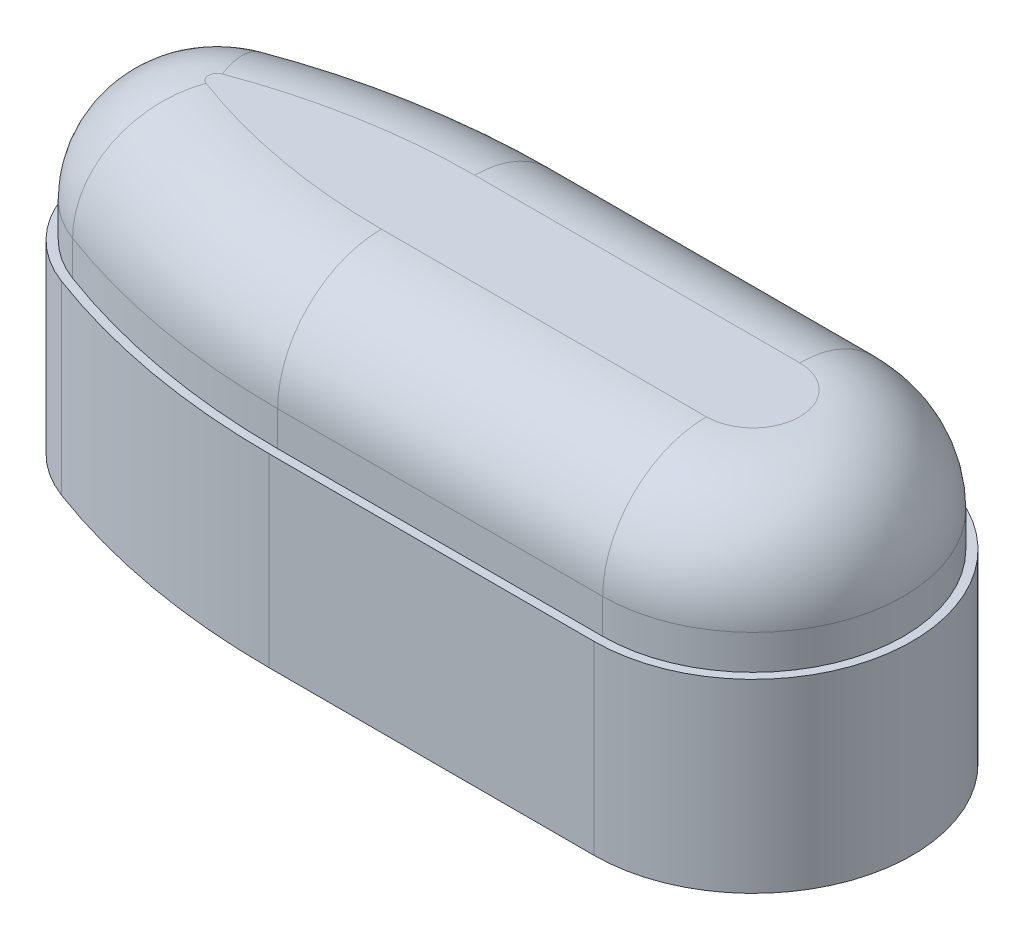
ISO-10303-21;
HEADER;
FILE_DESCRIPTION(('STEP AP214'),'2;1');
FILE_NAME('part.step','',(''),(''),'','','');
FILE_SCHEMA(('AUTOMOTIVE_DESIGN { 1 0 10303 214 1 1 1 1 }'));
ENDSEC;
DATA;
#1=APPLICATION_CONTEXT('core data for automotive mechanical design processes');
#2=APPLICATION_PROTOCOL_DEFINITION('international standard','automotive_design',2000,#1);
#3=PRODUCT_CONTEXT('',#1,'mechanical');
#4=PRODUCT('Part','Part','',(#3));
#5=PRODUCT_RELATED_PRODUCT_CATEGORY('part','',(#4));
#6=PRODUCT_DEFINITION_FORMATION('','',#4);
#7=PRODUCT_DEFINITION_CONTEXT('part definition',#1,'design');
#8=PRODUCT_DEFINITION('design','',#6,#7);
#9=PRODUCT_DEFINITION_SHAPE('','',#8);
#10=(LENGTH_UNIT() NAMED_UNIT(*) SI_UNIT(.MILLI.,.METRE.));
#11=(NAMED_UNIT(*) PLANE_ANGLE_UNIT() SI_UNIT($,.RADIAN.));
#12=(NAMED_UNIT(*) SI_UNIT($,.STERADIAN.) SOLID_ANGLE_UNIT());
#13=UNCERTAINTY_MEASURE_WITH_UNIT(LENGTH_MEASURE(1.E-05),#10,'distance_accuracy_value','');
#14=(GEOMETRIC_REPRESENTATION_CONTEXT(3) GLOBAL_UNCERTAINTY_ASSIGNED_CONTEXT((#13)) GLOBAL_UNIT_ASSIGNED_CONTEXT((#10,
#11,#12)) REPRESENTATION_CONTEXT('',''));
#15=CARTESIAN_POINT('',(0.,0.,0.));
#16=DIRECTION('',(0.,0.,1.));
#17=DIRECTION('',(1.,0.,0.));
#18=AXIS2_PLACEMENT_3D('',#15,#16,#17);
#19=CARTESIAN_POINT('',(0.,18.72,0.));
#20=DIRECTION('',(0.,-1.,0.));
#21=DIRECTION('',(0.,0.,-1.));
#22=AXIS2_PLACEMENT_3D('',#19,#20,#21);
#23=CYLINDRICAL_SURFACE('',#22,9.2);
#24=CARTESIAN_POINT('',(0.,10.72,0.));
#25=DIRECTION('',(0.,1.,0.));
#26=DIRECTION('',(0.,0.,1.));
#27=AXIS2_PLACEMENT_3D('',#24,#25,#26);
#28=CIRCLE('',#27,9.2);
#29=CARTESIAN_POINT('',(0.,10.72,9.2));
#30=VERTEX_POINT('',#29);
#31=CARTESIAN_POINT('',(0.,10.72,-9.2));
#32=VERTEX_POINT('',#31);
#33=EDGE_CURVE('E724',#30,#32,#28,.T.);
#34=ORIENTED_EDGE('',*,*,#33,.F.);
#35=DIRECTION('',(0.,-1.,0.));
#36=VECTOR('',#35,1.);
#37=CARTESIAN_POINT('',(0.,18.72,9.2));
#38=LINE('',#37,#36);
#39=CARTESIAN_POINT('',(0.,0.,9.2));
#40=VERTEX_POINT('',#39);
#41=EDGE_CURVE('E727',#30,#40,#38,.T.);
#42=ORIENTED_EDGE('',*,*,#41,.T.);
#43=CARTESIAN_POINT('',(0.,0.,0.));
#44=DIRECTION('',(0.,1.,0.));
#45=DIRECTION('',(0.,0.,1.));
#46=AXIS2_PLACEMENT_3D('',#43,#44,#45);
#47=CIRCLE('',#46,9.2);
#48=CARTESIAN_POINT('',(0.,0.,-9.2));
#49=VERTEX_POINT('',#48);
#50=EDGE_CURVE('E730',#40,#49,#47,.T.);
#51=ORIENTED_EDGE('',*,*,#50,.T.);
#52=DIRECTION('',(0.,-1.,0.));
#53=VECTOR('',#52,1.);
#54=CARTESIAN_POINT('',(0.,18.72,-9.2));
#55=LINE('',#54,#53);
#56=EDGE_CURVE('E41',#32,#49,#55,.T.);
#57=ORIENTED_EDGE('',*,*,#56,.F.);
#58=EDGE_LOOP('',(#34,#42,#51,#57));
#59=FACE_BOUND('',#58,.T.);
#60=ADVANCED_FACE('F34',(#59),#23,.T.);
#61=CARTESIAN_POINT('',(0.,18.72,-9.2));
#62=DIRECTION('',(0.,0.,1.));
#63=DIRECTION('',(1.,0.,0.));
#64=AXIS2_PLACEMENT_3D('',#61,#62,#63);
#65=PLANE('',#64);
#66=DIRECTION('',(-1.,0.,0.));
#67=VECTOR('',#66,1.);
#68=CARTESIAN_POINT('',(0.,10.72,-9.2));
#69=LINE('',#68,#67);
#70=CARTESIAN_POINT('',(-18.8,10.72,-9.20000000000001));
#71=VERTEX_POINT('',#70);
#72=EDGE_CURVE('E731',#32,#71,#69,.T.);
#73=ORIENTED_EDGE('',*,*,#72,.F.);
#74=ORIENTED_EDGE('',*,*,#56,.T.);
#75=DIRECTION('',(-1.,0.,0.));
#76=VECTOR('',#75,1.);
#77=CARTESIAN_POINT('',(0.,0.,-9.2));
#78=LINE('',#77,#76);
#79=CARTESIAN_POINT('',(-18.8,0.,-9.19999999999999));
#80=VERTEX_POINT('',#79);
#81=EDGE_CURVE('E754',#49,#80,#78,.T.);
#82=ORIENTED_EDGE('',*,*,#81,.T.);
#83=DIRECTION('',(0.,-1.,0.));
#84=VECTOR('',#83,1.);
#85=CARTESIAN_POINT('',(-18.8,18.72,-9.19999999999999));
#86=LINE('',#85,#84);
#87=EDGE_CURVE('E750',#71,#80,#86,.T.);
#88=ORIENTED_EDGE('',*,*,#87,.F.);
#89=EDGE_LOOP('',(#73,#74,#82,#88));
#90=FACE_BOUND('',#89,.T.);
#91=ADVANCED_FACE('F715',(#90),#65,.F.);
#92=CARTESIAN_POINT('',(-18.8,18.72,32.7272727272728));
#93=DIRECTION('',(0.,-1.,0.));
#94=DIRECTION('',(0.,0.,-1.));
#95=AXIS2_PLACEMENT_3D('',#92,#93,#94);
#96=CYLINDRICAL_SURFACE('',#95,41.9272727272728);
#97=CARTESIAN_POINT('',(-18.8,10.72,32.7272727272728));
#98=DIRECTION('',(0.,1.,0.));
#99=DIRECTION('',(0.,0.,1.));
#100=AXIS2_PLACEMENT_3D('',#97,#98,#99);
#101=CIRCLE('',#100,41.9272727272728);
#102=CARTESIAN_POINT('',(-33.4450806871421,10.72,-6.55908381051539));
#103=VERTEX_POINT('',#102);
#104=EDGE_CURVE('E780',#71,#103,#101,.T.);
#105=ORIENTED_EDGE('',*,*,#104,.F.);
#106=ORIENTED_EDGE('',*,*,#87,.T.);
#107=CARTESIAN_POINT('',(-18.8,0.,32.7272727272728));
#108=DIRECTION('',(0.,1.,0.));
#109=DIRECTION('',(0.,0.,1.));
#110=AXIS2_PLACEMENT_3D('',#107,#108,#109);
#111=CIRCLE('',#110,41.9272727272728);
#112=CARTESIAN_POINT('',(-33.4450806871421,0.,-6.55908381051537));
#113=VERTEX_POINT('',#112);
#114=EDGE_CURVE('E760',#80,#113,#111,.T.);
#115=ORIENTED_EDGE('',*,*,#114,.T.);
#116=DIRECTION('',(0.,-1.,0.));
#117=VECTOR('',#116,1.);
#118=CARTESIAN_POINT('',(-33.4450806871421,18.72,-6.55908381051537));
#119=LINE('',#118,#117);
#120=EDGE_CURVE('E748',#103,#113,#119,.T.);
#121=ORIENTED_EDGE('',*,*,#120,.F.);
#122=EDGE_LOOP('',(#105,#106,#115,#121));
#123=FACE_BOUND('',#122,.T.);
#124=ADVANCED_FACE('F720',(#123),#96,.T.);
#125=CARTESIAN_POINT('',(-31.,18.72,0.));
#126=DIRECTION('',(0.,-1.,0.));
#127=DIRECTION('',(0.,0.,-1.));
#128=AXIS2_PLACEMENT_3D('',#125,#126,#127);
#129=CYLINDRICAL_SURFACE('',#128,7.00000000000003);
#130=CARTESIAN_POINT('',(-31.,10.72,0.));
#131=DIRECTION('',(0.,1.,0.));
#132=DIRECTION('',(0.,0.,1.));
#133=AXIS2_PLACEMENT_3D('',#130,#131,#132);
#134=CIRCLE('',#133,7.00000000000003);
#135=CARTESIAN_POINT('',(-33.4450806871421,10.72,6.55908381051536));
#136=VERTEX_POINT('',#135);
#137=EDGE_CURVE('E777',#103,#136,#134,.T.);
#138=ORIENTED_EDGE('',*,*,#137,.F.);
#139=ORIENTED_EDGE('',*,*,#120,.T.);
#140=CARTESIAN_POINT('',(-31.,0.,0.));
#141=DIRECTION('',(0.,1.,0.));
#142=DIRECTION('',(0.,0.,1.));
#143=AXIS2_PLACEMENT_3D('',#140,#141,#142);
#144=CIRCLE('',#143,7.00000000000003);
#145=CARTESIAN_POINT('',(-33.4450806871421,0.,6.55908381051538));
#146=VERTEX_POINT('',#145);
#147=EDGE_CURVE('E766',#113,#146,#144,.T.);
#148=ORIENTED_EDGE('',*,*,#147,.T.);
#149=DIRECTION('',(0.,-1.,0.));
#150=VECTOR('',#149,1.);
#151=CARTESIAN_POINT('',(-33.4450806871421,18.72,6.55908381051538));
#152=LINE('',#151,#150);
#153=EDGE_CURVE('E741',#136,#146,#152,.T.);
#154=ORIENTED_EDGE('',*,*,#153,.F.);
#155=EDGE_LOOP('',(#138,#139,#148,#154));
#156=FACE_BOUND('',#155,.T.);
#157=ADVANCED_FACE('F775',(#156),#129,.T.);
#158=CARTESIAN_POINT('',(-18.8,18.72,-32.7272727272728));
#159=DIRECTION('',(0.,-1.,0.));
#160=DIRECTION('',(0.,0.,-1.));
#161=AXIS2_PLACEMENT_3D('',#158,#159,#160);
#162=CYLINDRICAL_SURFACE('',#161,41.9272727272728);
#163=CARTESIAN_POINT('',(-18.8,10.72,-32.7272727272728));
#164=DIRECTION('',(0.,1.,0.));
#165=DIRECTION('',(0.,0.,1.));
#166=AXIS2_PLACEMENT_3D('',#163,#164,#165);
#167=CIRCLE('',#166,41.9272727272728);
#168=CARTESIAN_POINT('',(-18.8,10.72,9.20000000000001));
#169=VERTEX_POINT('',#168);
#170=EDGE_CURVE('E55',#136,#169,#167,.T.);
#171=ORIENTED_EDGE('',*,*,#170,.F.);
#172=ORIENTED_EDGE('',*,*,#153,.T.);
#173=CARTESIAN_POINT('',(-18.8,0.,-32.7272727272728));
#174=DIRECTION('',(0.,1.,0.));
#175=DIRECTION('',(0.,0.,-1.));
#176=AXIS2_PLACEMENT_3D('',#173,#174,#175);
#177=CIRCLE('',#176,41.9272727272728);
#178=CARTESIAN_POINT('',(-18.8,0.,9.20000000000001));
#179=VERTEX_POINT('',#178);
#180=EDGE_CURVE('E743',#146,#179,#177,.T.);
#181=ORIENTED_EDGE('',*,*,#180,.T.);
#182=DIRECTION('',(0.,-1.,0.));
#183=VECTOR('',#182,1.);
#184=CARTESIAN_POINT('',(-18.8,18.72,9.20000000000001));
#185=LINE('',#184,#183);
#186=EDGE_CURVE('E739',#169,#179,#185,.T.);
#187=ORIENTED_EDGE('',*,*,#186,.F.);
#188=EDGE_LOOP('',(#171,#172,#181,#187));
#189=FACE_BOUND('',#188,.T.);
#190=ADVANCED_FACE('F771',(#189),#162,.T.);
#191=CARTESIAN_POINT('',(0.,18.72,9.2));
#192=DIRECTION('',(0.,0.,-1.));
#193=DIRECTION('',(-1.,0.,0.));
#194=AXIS2_PLACEMENT_3D('',#191,#192,#193);
#195=PLANE('',#194);
#196=DIRECTION('',(1.,0.,0.));
#197=VECTOR('',#196,1.);
#198=CARTESIAN_POINT('',(0.,10.72,9.2));
#199=LINE('',#198,#197);
#200=EDGE_CURVE('E11',#169,#30,#199,.T.);
#201=ORIENTED_EDGE('',*,*,#200,.F.);
#202=ORIENTED_EDGE('',*,*,#186,.T.);
#203=DIRECTION('',(1.,0.,0.));
#204=VECTOR('',#203,1.);
#205=CARTESIAN_POINT('',(0.,0.,9.2));
#206=LINE('',#205,#204);
#207=EDGE_CURVE('E737',#179,#40,#206,.T.);
#208=ORIENTED_EDGE('',*,*,#207,.T.);
#209=ORIENTED_EDGE('',*,*,#41,.F.);
#210=EDGE_LOOP('',(#201,#202,#208,#209));
#211=FACE_BOUND('',#210,.T.);
#212=ADVANCED_FACE('F734',(#211),#195,.F.);
#213=CARTESIAN_POINT('',(0.,0.,0.));
#214=DIRECTION('',(0.,1.,0.));
#215=DIRECTION('',(0.,0.,1.));
#216=AXIS2_PLACEMENT_3D('',#213,#214,#215);
#217=PLANE('',#216);
#218=DIRECTION('',(1.,0.,0.));
#219=VECTOR('',#218,1.);
#220=CARTESIAN_POINT('',(0.,0.,7.2));
#221=LINE('',#220,#219);
#222=CARTESIAN_POINT('',(-18.8,0.,7.19999999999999));
#223=VERTEX_POINT('',#222);
#224=CARTESIAN_POINT('',(0.,0.,7.2));
#225=VERTEX_POINT('',#224);
#226=EDGE_CURVE('E662',#223,#225,#221,.T.);
#227=ORIENTED_EDGE('',*,*,#226,.T.);
#228=CARTESIAN_POINT('',(0.,0.,0.));
#229=DIRECTION('',(0.,1.,0.));
#230=DIRECTION('',(0.,0.,1.));
#231=AXIS2_PLACEMENT_3D('',#228,#229,#230);
#232=CIRCLE('',#231,7.2);
#233=CARTESIAN_POINT('',(0.,0.,-7.2));
#234=VERTEX_POINT('',#233);
#235=EDGE_CURVE('E240',#225,#234,#232,.T.);
#236=ORIENTED_EDGE('',*,*,#235,.T.);
#237=DIRECTION('',(-1.,0.,0.));
#238=VECTOR('',#237,1.);
#239=CARTESIAN_POINT('',(0.,0.,-7.2));
#240=LINE('',#239,#238);
#241=CARTESIAN_POINT('',(-18.8,0.,-7.2));
#242=VERTEX_POINT('',#241);
#243=EDGE_CURVE('E251',#234,#242,#240,.T.);
#244=ORIENTED_EDGE('',*,*,#243,.T.);
#245=CARTESIAN_POINT('',(-18.8,0.,32.7272727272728));
#246=DIRECTION('',(0.,1.,0.));
#247=DIRECTION('',(0.,0.,1.));
#248=AXIS2_PLACEMENT_3D('',#245,#246,#247);
#249=CIRCLE('',#248,39.9272727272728);
#250=CARTESIAN_POINT('',(-32.7464862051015,0.,-4.68505986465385));
#251=VERTEX_POINT('',#250);
#252=EDGE_CURVE('E48',#242,#251,#249,.T.);
#253=ORIENTED_EDGE('',*,*,#252,.T.);
#254=CARTESIAN_POINT('',(-31.,0.,0.));
#255=DIRECTION('',(0.,1.,0.));
#256=DIRECTION('',(0.,0.,1.));
#257=AXIS2_PLACEMENT_3D('',#254,#255,#256);
#258=CIRCLE('',#257,5.00000000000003);
#259=CARTESIAN_POINT('',(-32.7464862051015,0.,4.68505986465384));
#260=VERTEX_POINT('',#259);
#261=EDGE_CURVE('E656',#251,#260,#258,.T.);
#262=ORIENTED_EDGE('',*,*,#261,.T.);
#263=CARTESIAN_POINT('',(-18.8,0.,-32.7272727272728));
#264=DIRECTION('',(0.,1.,0.));
#265=DIRECTION('',(0.,0.,1.));
#266=AXIS2_PLACEMENT_3D('',#263,#264,#265);
#267=CIRCLE('',#266,39.9272727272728);
#268=EDGE_CURVE('E659',#260,#223,#267,.T.);
#269=ORIENTED_EDGE('',*,*,#268,.T.);
#270=EDGE_LOOP('',(#227,#236,#244,#253,#262,#269));
#271=FACE_BOUND('',#270,.T.);
#272=ORIENTED_EDGE('',*,*,#50,.F.);
#273=ORIENTED_EDGE('',*,*,#207,.F.);
#274=ORIENTED_EDGE('',*,*,#180,.F.);
#275=ORIENTED_EDGE('',*,*,#147,.F.);
#276=ORIENTED_EDGE('',*,*,#114,.F.);
#277=ORIENTED_EDGE('',*,*,#81,.F.);
#278=EDGE_LOOP('',(#272,#273,#274,#275,#276,#277));
#279=FACE_BOUND('',#278,.T.);
#280=ADVANCED_FACE('F757',(#271,#279),#217,.F.);
#281=CARTESIAN_POINT('',(-1.4370157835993E-13,10.72,10.2));
#282=DIRECTION('',(0.,1.,0.));
#283=DIRECTION('',(0.,0.,1.));
#284=AXIS2_PLACEMENT_3D('',#281,#282,#283);
#285=PLANE('',#284);
#286=DIRECTION('',(-1.,0.,0.));
#287=VECTOR('',#286,1.);
#288=CARTESIAN_POINT('',(-1.22568993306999E-13,10.72,8.7));
#289=LINE('',#288,#287);
#290=CARTESIAN_POINT('',(-1.22568993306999E-13,10.72,8.7));
#291=VERTEX_POINT('',#290);
#292=CARTESIAN_POINT('',(-18.8000000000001,10.72,8.70000000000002));
#293=VERTEX_POINT('',#292);
#294=EDGE_CURVE('E561',#291,#293,#289,.T.);
#295=ORIENTED_EDGE('',*,*,#294,.T.);
#296=CARTESIAN_POINT('',(-18.8,10.72,-32.7272727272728));
#297=DIRECTION('',(0.,-1.,0.));
#298=DIRECTION('',(0.,0.,-1.));
#299=AXIS2_PLACEMENT_3D('',#296,#297,#298);
#300=CIRCLE('',#299,41.4272727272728);
#301=CARTESIAN_POINT('',(-33.2704320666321,10.72,6.09057782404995));
#302=VERTEX_POINT('',#301);
#303=EDGE_CURVE('E609',#293,#302,#300,.T.);
#304=ORIENTED_EDGE('',*,*,#303,.T.);
#305=CARTESIAN_POINT('',(-31.,10.72,0.));
#306=DIRECTION('',(0.,-1.,0.));
#307=DIRECTION('',(0.,0.,-1.));
#308=AXIS2_PLACEMENT_3D('',#305,#306,#307);
#309=CIRCLE('',#308,6.50000000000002);
#310=CARTESIAN_POINT('',(-33.2704320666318,10.72,-6.09057782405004));
#311=VERTEX_POINT('',#310);
#312=EDGE_CURVE('E622',#302,#311,#309,.T.);
#313=ORIENTED_EDGE('',*,*,#312,.T.);
#314=CARTESIAN_POINT('',(-18.8,10.72,32.7272727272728));
#315=DIRECTION('',(0.,-1.,0.));
#316=DIRECTION('',(0.,0.,-1.));
#317=AXIS2_PLACEMENT_3D('',#314,#315,#316);
#318=CIRCLE('',#317,41.4272727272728);
#319=CARTESIAN_POINT('',(-18.7999999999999,10.72,-8.70000000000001));
#320=VERTEX_POINT('',#319);
#321=EDGE_CURVE('E564',#311,#320,#318,.T.);
#322=ORIENTED_EDGE('',*,*,#321,.T.);
#323=DIRECTION('',(1.,0.,0.));
#324=VECTOR('',#323,1.);
#325=CARTESIAN_POINT('',(-18.7999999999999,10.72,-8.70000000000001));
#326=LINE('',#325,#324);
#327=CARTESIAN_POINT('',(0.,10.72,-8.7));
#328=VERTEX_POINT('',#327);
#329=EDGE_CURVE('E526',#320,#328,#326,.T.);
#330=ORIENTED_EDGE('',*,*,#329,.T.);
#331=CARTESIAN_POINT('',(0.,10.72,0.));
#332=DIRECTION('',(0.,1.,0.));
#333=DIRECTION('',(0.,0.,1.));
#334=AXIS2_PLACEMENT_3D('',#331,#332,#333);
#335=CIRCLE('',#334,8.7);
#336=EDGE_CURVE('E451',#291,#328,#335,.T.);
#337=ORIENTED_EDGE('',*,*,#336,.F.);
#338=EDGE_LOOP('',(#295,#304,#313,#322,#330,#337));
#339=FACE_BOUND('',#338,.T.);
#340=ORIENTED_EDGE('',*,*,#33,.T.);
#341=ORIENTED_EDGE('',*,*,#72,.T.);
#342=ORIENTED_EDGE('',*,*,#104,.T.);
#343=ORIENTED_EDGE('',*,*,#137,.T.);
#344=ORIENTED_EDGE('',*,*,#170,.T.);
#345=ORIENTED_EDGE('',*,*,#200,.T.);
#346=EDGE_LOOP('',(#340,#341,#342,#343,#344,#345));
#347=FACE_BOUND('',#346,.T.);
#348=ADVANCED_FACE('F434',(#339,#347),#285,.T.);
#349=CARTESIAN_POINT('',(-18.7999999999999,12.72,-8.70000000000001));
#350=DIRECTION('',(0.,0.,1.));
#351=DIRECTION('',(0.,-1.,0.));
#352=AXIS2_PLACEMENT_3D('',#349,#350,#351);
#353=PLANE('',#352);
#354=DIRECTION('',(0.,-1.,0.));
#355=VECTOR('',#354,1.);
#356=CARTESIAN_POINT('',(-18.7999999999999,12.72,-8.70000000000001));
#357=LINE('',#356,#355);
#358=CARTESIAN_POINT('',(-18.7999999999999,12.72,-8.70000000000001));
#359=VERTEX_POINT('',#358);
#360=EDGE_CURVE('E567',#359,#320,#357,.T.);
#361=ORIENTED_EDGE('',*,*,#360,.F.);
#362=DIRECTION('',(1.,0.,0.));
#363=VECTOR('',#362,1.);
#364=CARTESIAN_POINT('',(-18.7999999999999,12.72,-8.70000000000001));
#365=LINE('',#364,#363);
#366=CARTESIAN_POINT('',(1.2490009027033E-13,12.72,-8.70000000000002));
#367=VERTEX_POINT('',#366);
#368=EDGE_CURVE('E529',#359,#367,#365,.T.);
#369=ORIENTED_EDGE('',*,*,#368,.T.);
#370=CARTESIAN_POINT('',(1.2490009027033E-13,12.72,-8.70000000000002));
#371=DIRECTION('',(0.,-1.,0.));
#372=VECTOR('',#371,1.);
#373=LINE('',#370,#372);
#374=EDGE_CURVE('E460',#367,#328,#373,.T.);
#375=ORIENTED_EDGE('',*,*,#374,.T.);
#376=ORIENTED_EDGE('',*,*,#329,.F.);
#377=EDGE_LOOP('',(#361,#369,#375,#376));
#378=FACE_BOUND('',#377,.T.);
#379=ADVANCED_FACE('F509',(#378),#353,.F.);
#380=CARTESIAN_POINT('',(-18.8,12.72,-2.70000000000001));
#381=DIRECTION('',(1.,0.,0.));
#382=DIRECTION('',(0.,0.,-1.));
#383=AXIS2_PLACEMENT_3D('',#380,#381,#382);
#384=CYLINDRICAL_SURFACE('',#383,6.);
#385=CARTESIAN_POINT('',(-18.8,12.72,-2.70000000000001));
#386=DIRECTION('',(-1.,0.,0.));
#387=DIRECTION('',(0.,0.,-1.));
#388=AXIS2_PLACEMENT_3D('',#385,#386,#387);
#389=CIRCLE('',#388,6.);
#390=CARTESIAN_POINT('',(-18.8,18.72,-2.70000000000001));
#391=VERTEX_POINT('',#390);
#392=EDGE_CURVE('E573',#391,#359,#389,.T.);
#393=ORIENTED_EDGE('',*,*,#392,.F.);
#394=DIRECTION('',(1.,0.,0.));
#395=VECTOR('',#394,1.);
#396=CARTESIAN_POINT('',(-18.8,18.72,-2.70000000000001));
#397=LINE('',#396,#395);
#398=CARTESIAN_POINT('',(0.,18.72,-2.7));
#399=VERTEX_POINT('',#398);
#400=EDGE_CURVE('E519',#391,#399,#397,.T.);
#401=ORIENTED_EDGE('',*,*,#400,.T.);
#402=CARTESIAN_POINT('',(0.,12.72,-2.70000000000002));
#403=DIRECTION('',(-1.,0.,0.));
#404=DIRECTION('',(0.,1.,0.));
#405=AXIS2_PLACEMENT_3D('',#402,#403,#404);
#406=CIRCLE('',#405,6.);
#407=EDGE_CURVE('E582',#399,#367,#406,.T.);
#408=ORIENTED_EDGE('',*,*,#407,.T.);
#409=ORIENTED_EDGE('',*,*,#368,.F.);
#410=EDGE_LOOP('',(#393,#401,#408,#409));
#411=FACE_BOUND('',#410,.T.);
#412=ADVANCED_FACE('F504',(#411),#384,.T.);
#413=CARTESIAN_POINT('',(-18.8,18.72,32.7272727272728));
#414=DIRECTION('',(0.,-1.,0.));
#415=DIRECTION('',(0.,0.,-1.));
#416=AXIS2_PLACEMENT_3D('',#413,#414,#415);
#417=CYLINDRICAL_SURFACE('',#416,41.4272727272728);
#418=DIRECTION('',(0.,-1.,0.));
#419=VECTOR('',#418,1.);
#420=CARTESIAN_POINT('',(-33.2704320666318,12.72,-6.09057782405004));
#421=LINE('',#420,#419);
#422=CARTESIAN_POINT('',(-33.2704320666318,12.72,-6.09057782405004));
#423=VERTEX_POINT('',#422);
#424=EDGE_CURVE('E617',#423,#311,#421,.T.);
#425=ORIENTED_EDGE('',*,*,#424,.F.);
#426=CARTESIAN_POINT('',(-18.8,12.72,32.7272727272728));
#427=DIRECTION('',(0.,-1.,0.));
#428=DIRECTION('',(0.,0.,-1.));
#429=AXIS2_PLACEMENT_3D('',#426,#427,#428);
#430=CIRCLE('',#429,41.4272727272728);
#431=EDGE_CURVE('E571',#423,#359,#430,.T.);
#432=ORIENTED_EDGE('',*,*,#431,.T.);
#433=ORIENTED_EDGE('',*,*,#360,.T.);
#434=ORIENTED_EDGE('',*,*,#321,.F.);
#435=EDGE_LOOP('',(#425,#432,#433,#434));
#436=FACE_BOUND('',#435,.T.);
#437=ADVANCED_FACE('F500',(#436),#417,.T.);
#438=CARTESIAN_POINT('',(-18.8,12.72,32.7272727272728));
#439=DIRECTION('',(0.,-1.,0.));
#440=DIRECTION('',(0.,0.,-1.));
#441=AXIS2_PLACEMENT_3D('',#438,#439,#440);
#442=TOROIDAL_SURFACE('',#441,35.4272727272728,6.);
#443=CARTESIAN_POINT('',(-31.1746486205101,12.72,-0.468505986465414));
#444=DIRECTION('',(-0.93701197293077,0.,0.349297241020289));
#445=DIRECTION('',(-0.349297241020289,0.,-0.93701197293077));
#446=AXIS2_PLACEMENT_3D('',#443,#444,#445);
#447=CIRCLE('',#446,6.);
#448=CARTESIAN_POINT('',(-31.1746486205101,18.72,-0.468505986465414));
#449=VERTEX_POINT('',#448);
#450=EDGE_CURVE('E614',#449,#423,#447,.T.);
#451=ORIENTED_EDGE('',*,*,#450,.F.);
#452=CARTESIAN_POINT('',(-18.8,18.72,32.7272727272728));
#453=DIRECTION('',(0.,-1.,0.));
#454=DIRECTION('',(0.,0.,-1.));
#455=AXIS2_PLACEMENT_3D('',#452,#453,#454);
#456=CIRCLE('',#455,35.4272727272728);
#457=EDGE_CURVE('E572',#449,#391,#456,.T.);
#458=ORIENTED_EDGE('',*,*,#457,.T.);
#459=ORIENTED_EDGE('',*,*,#392,.T.);
#460=ORIENTED_EDGE('',*,*,#431,.F.);
#461=EDGE_LOOP('',(#451,#458,#459,#460));
#462=FACE_BOUND('',#461,.T.);
#463=ADVANCED_FACE('F496',(#462),#442,.T.);
#464=CARTESIAN_POINT('',(-31.,18.72,0.));
#465=DIRECTION('',(0.,-1.,0.));
#466=DIRECTION('',(0.,0.,-1.));
#467=AXIS2_PLACEMENT_3D('',#464,#465,#466);
#468=CYLINDRICAL_SURFACE('',#467,6.50000000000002);
#469=DIRECTION('',(0.,-1.,0.));
#470=VECTOR('',#469,1.);
#471=CARTESIAN_POINT('',(-33.2704320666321,12.72,6.09057782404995));
#472=LINE('',#471,#470);
#473=CARTESIAN_POINT('',(-33.2704320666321,12.72,6.09057782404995));
#474=VERTEX_POINT('',#473);
#475=EDGE_CURVE('E605',#474,#302,#472,.T.);
#476=ORIENTED_EDGE('',*,*,#475,.F.);
#477=CARTESIAN_POINT('',(-31.,12.72,0.));
#478=DIRECTION('',(0.,-1.,0.));
#479=DIRECTION('',(0.,0.,-1.));
#480=AXIS2_PLACEMENT_3D('',#477,#478,#479);
#481=CIRCLE('',#480,6.50000000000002);
#482=EDGE_CURVE('E578',#474,#423,#481,.T.);
#483=ORIENTED_EDGE('',*,*,#482,.T.);
#484=ORIENTED_EDGE('',*,*,#424,.T.);
#485=ORIENTED_EDGE('',*,*,#312,.F.);
#486=EDGE_LOOP('',(#476,#483,#484,#485));
#487=FACE_BOUND('',#486,.T.);
#488=ADVANCED_FACE('F492',(#487),#468,.T.);
#489=CARTESIAN_POINT('',(-31.,12.72,0.));
#490=DIRECTION('',(0.,-1.,0.));
#491=DIRECTION('',(0.,0.,-1.));
#492=AXIS2_PLACEMENT_3D('',#489,#490,#491);
#493=DEGENERATE_TOROIDAL_SURFACE('',#492,0.500000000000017,6.,.T.);
#494=CARTESIAN_POINT('',(-31.1746486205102,12.72,0.468505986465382));
#495=DIRECTION('',(0.937011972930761,0.,0.349297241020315));
#496=DIRECTION('',(-0.349297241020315,0.,0.937011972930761));
#497=AXIS2_PLACEMENT_3D('',#494,#495,#496);
#498=CIRCLE('',#497,6.);
#499=CARTESIAN_POINT('',(-31.1746486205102,18.72,0.468505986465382));
#500=VERTEX_POINT('',#499);
#501=EDGE_CURVE('E602',#500,#474,#498,.T.);
#502=ORIENTED_EDGE('',*,*,#501,.F.);
#503=CARTESIAN_POINT('',(-31.,18.72,0.));
#504=DIRECTION('',(0.,-1.,0.));
#505=DIRECTION('',(0.,0.,-1.));
#506=AXIS2_PLACEMENT_3D('',#503,#504,#505);
#507=CIRCLE('',#506,0.500000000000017);
#508=EDGE_CURVE('E619',#500,#449,#507,.T.);
#509=ORIENTED_EDGE('',*,*,#508,.T.);
#510=ORIENTED_EDGE('',*,*,#450,.T.);
#511=ORIENTED_EDGE('',*,*,#482,.F.);
#512=EDGE_LOOP('',(#502,#509,#510,#511));
#513=FACE_BOUND('',#512,.T.);
#514=ADVANCED_FACE('F488',(#513),#493,.T.);
#515=CARTESIAN_POINT('',(-18.8,18.72,-32.7272727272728));
#516=DIRECTION('',(0.,-1.,0.));
#517=DIRECTION('',(0.,0.,-1.));
#518=AXIS2_PLACEMENT_3D('',#515,#516,#517);
#519=CYLINDRICAL_SURFACE('',#518,41.4272727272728);
#520=DIRECTION('',(0.,-1.,0.));
#521=VECTOR('',#520,1.);
#522=CARTESIAN_POINT('',(-18.8000000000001,12.72,8.70000000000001));
#523=LINE('',#522,#521);
#524=CARTESIAN_POINT('',(-18.8000000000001,12.72,8.70000000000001));
#525=VERTEX_POINT('',#524);
#526=EDGE_CURVE('E553',#525,#293,#523,.T.);
#527=ORIENTED_EDGE('',*,*,#526,.F.);
#528=CARTESIAN_POINT('',(-18.8,12.72,-32.7272727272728));
#529=DIRECTION('',(0.,-1.,0.));
#530=DIRECTION('',(0.,0.,-1.));
#531=AXIS2_PLACEMENT_3D('',#528,#529,#530);
#532=CIRCLE('',#531,41.4272727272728);
#533=EDGE_CURVE('E611',#525,#474,#532,.T.);
#534=ORIENTED_EDGE('',*,*,#533,.T.);
#535=ORIENTED_EDGE('',*,*,#475,.T.);
#536=ORIENTED_EDGE('',*,*,#303,.F.);
#537=EDGE_LOOP('',(#527,#534,#535,#536));
#538=FACE_BOUND('',#537,.T.);
#539=ADVANCED_FACE('F484',(#538),#519,.T.);
#540=CARTESIAN_POINT('',(-18.8,12.72,-32.7272727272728));
#541=DIRECTION('',(0.,-1.,0.));
#542=DIRECTION('',(0.,0.,-1.));
#543=AXIS2_PLACEMENT_3D('',#540,#541,#542);
#544=TOROIDAL_SURFACE('',#543,35.4272727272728,6.);
#545=CARTESIAN_POINT('',(-18.8,12.72,2.70000000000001));
#546=DIRECTION('',(1.,0.,0.));
#547=DIRECTION('',(0.,0.,1.));
#548=AXIS2_PLACEMENT_3D('',#545,#546,#547);
#549=CIRCLE('',#548,6.);
#550=CARTESIAN_POINT('',(-18.8,18.72,2.70000000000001));
#551=VERTEX_POINT('',#550);
#552=EDGE_CURVE('E549',#551,#525,#549,.T.);
#553=ORIENTED_EDGE('',*,*,#552,.F.);
#554=CARTESIAN_POINT('',(-18.8,18.72,-32.7272727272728));
#555=DIRECTION('',(0.,-1.,0.));
#556=DIRECTION('',(0.,0.,-1.));
#557=AXIS2_PLACEMENT_3D('',#554,#555,#556);
#558=CIRCLE('',#557,35.4272727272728);
#559=EDGE_CURVE('E593',#551,#500,#558,.T.);
#560=ORIENTED_EDGE('',*,*,#559,.T.);
#561=ORIENTED_EDGE('',*,*,#501,.T.);
#562=ORIENTED_EDGE('',*,*,#533,.F.);
#563=EDGE_LOOP('',(#553,#560,#561,#562));
#564=FACE_BOUND('',#563,.T.);
#565=ADVANCED_FACE('F480',(#564),#544,.T.);
#566=CARTESIAN_POINT('',(-1.22568993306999E-13,12.72,8.7));
#567=DIRECTION('',(0.,0.,-1.));
#568=DIRECTION('',(0.,1.,0.));
#569=AXIS2_PLACEMENT_3D('',#566,#567,#568);
#570=PLANE('',#569);
#571=DIRECTION('',(0.,-1.,0.));
#572=VECTOR('',#571,1.);
#573=CARTESIAN_POINT('',(-1.22568993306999E-13,12.72,8.7));
#574=LINE('',#573,#572);
#575=CARTESIAN_POINT('',(-1.22568993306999E-13,12.72,8.7));
#576=VERTEX_POINT('',#575);
#577=EDGE_CURVE('E452',#576,#291,#574,.T.);
#578=ORIENTED_EDGE('',*,*,#577,.F.);
#579=DIRECTION('',(-1.,0.,0.));
#580=VECTOR('',#579,1.);
#581=CARTESIAN_POINT('',(-1.22568993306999E-13,12.72,8.7));
#582=LINE('',#581,#580);
#583=EDGE_CURVE('E595',#576,#525,#582,.T.);
#584=ORIENTED_EDGE('',*,*,#583,.T.);
#585=ORIENTED_EDGE('',*,*,#526,.T.);
#586=ORIENTED_EDGE('',*,*,#294,.F.);
#587=EDGE_LOOP('',(#578,#584,#585,#586));
#588=FACE_BOUND('',#587,.T.);
#589=ADVANCED_FACE('F476',(#588),#570,.F.);
#590=CARTESIAN_POINT('',(0.,12.72,2.7));
#591=DIRECTION('',(-1.,0.,0.));
#592=DIRECTION('',(0.,0.,1.));
#593=AXIS2_PLACEMENT_3D('',#590,#591,#592);
#594=CYLINDRICAL_SURFACE('',#593,6.);
#595=CARTESIAN_POINT('',(0.,12.72,2.7));
#596=DIRECTION('',(1.,0.,0.));
#597=DIRECTION('',(0.,0.,1.));
#598=AXIS2_PLACEMENT_3D('',#595,#596,#597);
#599=CIRCLE('',#598,6.);
#600=CARTESIAN_POINT('',(0.,18.72,2.7));
#601=VERTEX_POINT('',#600);
#602=EDGE_CURVE('E256',#601,#576,#599,.T.);
#603=ORIENTED_EDGE('',*,*,#602,.F.);
#604=DIRECTION('',(-1.,0.,0.));
#605=VECTOR('',#604,1.);
#606=CARTESIAN_POINT('',(0.,18.72,2.7));
#607=LINE('',#606,#605);
#608=EDGE_CURVE('E590',#601,#551,#607,.T.);
#609=ORIENTED_EDGE('',*,*,#608,.T.);
#610=ORIENTED_EDGE('',*,*,#552,.T.);
#611=ORIENTED_EDGE('',*,*,#583,.F.);
#612=EDGE_LOOP('',(#603,#609,#610,#611));
#613=FACE_BOUND('',#612,.T.);
#614=ADVANCED_FACE('F432',(#613),#594,.T.);
#615=CARTESIAN_POINT('',(0.,12.72,0.));
#616=DIRECTION('',(0.,1.,0.));
#617=DIRECTION('',(0.,0.,1.));
#618=AXIS2_PLACEMENT_3D('',#615,#616,#617);
#619=DEGENERATE_TOROIDAL_SURFACE('',#618,2.7,6.,.T.);
#620=CARTESIAN_POINT('',(0.,12.72,0.));
#621=DIRECTION('',(0.,1.,0.));
#622=DIRECTION('',(0.,0.,1.));
#623=AXIS2_PLACEMENT_3D('',#620,#621,#622);
#624=CIRCLE('',#623,8.7);
#625=EDGE_CURVE('E547',#576,#367,#624,.T.);
#626=ORIENTED_EDGE('',*,*,#625,.T.);
#627=ORIENTED_EDGE('',*,*,#407,.F.);
#628=CARTESIAN_POINT('',(0.,18.72,0.));
#629=DIRECTION('',(0.,1.,0.));
#630=DIRECTION('',(0.,0.,1.));
#631=AXIS2_PLACEMENT_3D('',#628,#629,#630);
#632=CIRCLE('',#631,2.7);
#633=EDGE_CURVE('E443',#601,#399,#632,.T.);
#634=ORIENTED_EDGE('',*,*,#633,.F.);
#635=ORIENTED_EDGE('',*,*,#602,.T.);
#636=EDGE_LOOP('',(#626,#627,#634,#635));
#637=FACE_BOUND('',#636,.T.);
#638=ADVANCED_FACE('F427',(#637),#619,.T.);
#639=CARTESIAN_POINT('',(0.,18.72,0.));
#640=DIRECTION('',(0.,1.,0.));
#641=DIRECTION('',(0.,0.,1.));
#642=AXIS2_PLACEMENT_3D('',#639,#640,#641);
#643=CYLINDRICAL_SURFACE('',#642,8.7);
#644=ORIENTED_EDGE('',*,*,#336,.T.);
#645=ORIENTED_EDGE('',*,*,#374,.F.);
#646=ORIENTED_EDGE('',*,*,#625,.F.);
#647=ORIENTED_EDGE('',*,*,#577,.T.);
#648=EDGE_LOOP('',(#644,#645,#646,#647));
#649=FACE_BOUND('',#648,.T.);
#650=ADVANCED_FACE('F431',(#649),#643,.T.);
#651=CARTESIAN_POINT('',(0.,18.72,0.));
#652=DIRECTION('',(0.,1.,0.));
#653=DIRECTION('',(0.,0.,1.));
#654=AXIS2_PLACEMENT_3D('',#651,#652,#653);
#655=PLANE('',#654);
#656=ORIENTED_EDGE('',*,*,#400,.F.);
#657=ORIENTED_EDGE('',*,*,#457,.F.);
#658=ORIENTED_EDGE('',*,*,#508,.F.);
#659=ORIENTED_EDGE('',*,*,#559,.F.);
#660=ORIENTED_EDGE('',*,*,#608,.F.);
#661=ORIENTED_EDGE('',*,*,#633,.T.);
#662=EDGE_LOOP('',(#656,#657,#658,#659,#660,#661));
#663=FACE_BOUND('',#662,.T.);
#664=ADVANCED_FACE('F372',(#663),#655,.T.);
#665=CARTESIAN_POINT('',(0.,18.72,0.));
#666=DIRECTION('',(0.,-1.,0.));
#667=DIRECTION('',(0.,0.,-1.));
#668=AXIS2_PLACEMENT_3D('',#665,#666,#667);
#669=CYLINDRICAL_SURFACE('',#668,7.2);
#670=CARTESIAN_POINT('',(0.,8.72,0.));
#671=DIRECTION('',(0.,1.,0.));
#672=DIRECTION('',(0.,0.,1.));
#673=AXIS2_PLACEMENT_3D('',#670,#671,#672);
#674=CIRCLE('',#673,7.2);
#675=CARTESIAN_POINT('',(0.,8.72,7.2));
#676=VERTEX_POINT('',#675);
#677=CARTESIAN_POINT('',(0.,8.72,-7.2));
#678=VERTEX_POINT('',#677);
#679=EDGE_CURVE('E230',#676,#678,#674,.T.);
#680=ORIENTED_EDGE('',*,*,#679,.T.);
#681=DIRECTION('',(0.,1.,0.));
#682=VECTOR('',#681,1.);
#683=CARTESIAN_POINT('',(0.,18.72,-7.2));
#684=LINE('',#683,#682);
#685=EDGE_CURVE('E235',#678,#234,#684,.F.);
#686=ORIENTED_EDGE('',*,*,#685,.T.);
#687=ORIENTED_EDGE('',*,*,#235,.F.);
#688=DIRECTION('',(0.,-1.,0.));
#689=VECTOR('',#688,1.);
#690=CARTESIAN_POINT('',(0.,18.72,7.2));
#691=LINE('',#690,#689);
#692=EDGE_CURVE('E237',#676,#225,#691,.T.);
#693=ORIENTED_EDGE('',*,*,#692,.F.);
#694=EDGE_LOOP('',(#680,#686,#687,#693));
#695=FACE_BOUND('',#694,.T.);
#696=ADVANCED_FACE('F232',(#695),#669,.F.);
#697=CARTESIAN_POINT('',(0.,18.72,-7.2));
#698=DIRECTION('',(0.,0.,1.));
#699=DIRECTION('',(1.,0.,0.));
#700=AXIS2_PLACEMENT_3D('',#697,#698,#699);
#701=PLANE('',#700);
#702=DIRECTION('',(-1.,0.,0.));
#703=VECTOR('',#702,1.);
#704=CARTESIAN_POINT('',(0.,8.72,-7.2));
#705=LINE('',#704,#703);
#706=CARTESIAN_POINT('',(-18.8,8.72,-7.2));
#707=VERTEX_POINT('',#706);
#708=EDGE_CURVE('E241',#678,#707,#705,.T.);
#709=ORIENTED_EDGE('',*,*,#708,.T.);
#710=DIRECTION('',(0.,-1.,0.));
#711=VECTOR('',#710,1.);
#712=CARTESIAN_POINT('',(-18.8,18.72,-7.2));
#713=LINE('',#712,#711);
#714=EDGE_CURVE('E254',#707,#242,#713,.T.);
#715=ORIENTED_EDGE('',*,*,#714,.T.);
#716=ORIENTED_EDGE('',*,*,#243,.F.);
#717=ORIENTED_EDGE('',*,*,#685,.F.);
#718=EDGE_LOOP('',(#709,#715,#716,#717));
#719=FACE_BOUND('',#718,.T.);
#720=ADVANCED_FACE('F249',(#719),#701,.T.);
#721=CARTESIAN_POINT('',(-18.8,18.72,32.7272727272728));
#722=DIRECTION('',(0.,-1.,0.));
#723=DIRECTION('',(0.,0.,-1.));
#724=AXIS2_PLACEMENT_3D('',#721,#722,#723);
#725=CYLINDRICAL_SURFACE('',#724,39.9272727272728);
#726=CARTESIAN_POINT('',(-18.8,8.72,32.7272727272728));
#727=DIRECTION('',(0.,1.,0.));
#728=DIRECTION('',(0.,0.,1.));
#729=AXIS2_PLACEMENT_3D('',#726,#727,#728);
#730=CIRCLE('',#729,39.9272727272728);
#731=CARTESIAN_POINT('',(-32.7464862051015,8.72,-4.68505986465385));
#732=VERTEX_POINT('',#731);
#733=EDGE_CURVE('E246',#707,#732,#730,.T.);
#734=ORIENTED_EDGE('',*,*,#733,.T.);
#735=DIRECTION('',(0.,-1.,0.));
#736=VECTOR('',#735,1.);
#737=CARTESIAN_POINT('',(-32.7464862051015,18.72,-4.68505986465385));
#738=LINE('',#737,#736);
#739=EDGE_CURVE('E258',#732,#251,#738,.T.);
#740=ORIENTED_EDGE('',*,*,#739,.T.);
#741=ORIENTED_EDGE('',*,*,#252,.F.);
#742=ORIENTED_EDGE('',*,*,#714,.F.);
#743=EDGE_LOOP('',(#734,#740,#741,#742));
#744=FACE_BOUND('',#743,.T.);
#745=ADVANCED_FACE('F375',(#744),#725,.F.);
#746=CARTESIAN_POINT('',(-31.,18.72,0.));
#747=DIRECTION('',(0.,-1.,0.));
#748=DIRECTION('',(0.,0.,-1.));
#749=AXIS2_PLACEMENT_3D('',#746,#747,#748);
#750=CYLINDRICAL_SURFACE('',#749,5.00000000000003);
#751=CARTESIAN_POINT('',(-31.,8.72,0.));
#752=DIRECTION('',(0.,1.,0.));
#753=DIRECTION('',(0.,0.,1.));
#754=AXIS2_PLACEMENT_3D('',#751,#752,#753);
#755=CIRCLE('',#754,5.00000000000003);
#756=CARTESIAN_POINT('',(-32.7464862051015,8.72,4.68505986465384));
#757=VERTEX_POINT('',#756);
#758=EDGE_CURVE('E263',#732,#757,#755,.T.);
#759=ORIENTED_EDGE('',*,*,#758,.T.);
#760=DIRECTION('',(0.,-1.,0.));
#761=VECTOR('',#760,1.);
#762=CARTESIAN_POINT('',(-32.7464862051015,18.72,4.68505986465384));
#763=LINE('',#762,#761);
#764=EDGE_CURVE('E265',#757,#260,#763,.T.);
#765=ORIENTED_EDGE('',*,*,#764,.T.);
#766=ORIENTED_EDGE('',*,*,#261,.F.);
#767=ORIENTED_EDGE('',*,*,#739,.F.);
#768=EDGE_LOOP('',(#759,#765,#766,#767));
#769=FACE_BOUND('',#768,.T.);
#770=ADVANCED_FACE('F378',(#769),#750,.F.);
#771=CARTESIAN_POINT('',(-18.8,18.72,-32.7272727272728));
#772=DIRECTION('',(0.,-1.,0.));
#773=DIRECTION('',(0.,0.,-1.));
#774=AXIS2_PLACEMENT_3D('',#771,#772,#773);
#775=CYLINDRICAL_SURFACE('',#774,39.9272727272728);
#776=CARTESIAN_POINT('',(-18.8,8.72,-32.7272727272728));
#777=DIRECTION('',(0.,1.,0.));
#778=DIRECTION('',(0.,0.,1.));
#779=AXIS2_PLACEMENT_3D('',#776,#777,#778);
#780=CIRCLE('',#779,39.9272727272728);
#781=CARTESIAN_POINT('',(-18.8,8.72,7.19999999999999));
#782=VERTEX_POINT('',#781);
#783=EDGE_CURVE('E267',#757,#782,#780,.T.);
#784=ORIENTED_EDGE('',*,*,#783,.T.);
#785=DIRECTION('',(0.,1.,0.));
#786=VECTOR('',#785,1.);
#787=CARTESIAN_POINT('',(-18.8,18.72,7.19999999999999));
#788=LINE('',#787,#786);
#789=EDGE_CURVE('E269',#782,#223,#788,.F.);
#790=ORIENTED_EDGE('',*,*,#789,.T.);
#791=ORIENTED_EDGE('',*,*,#268,.F.);
#792=ORIENTED_EDGE('',*,*,#764,.F.);
#793=EDGE_LOOP('',(#784,#790,#791,#792));
#794=FACE_BOUND('',#793,.T.);
#795=ADVANCED_FACE('F381',(#794),#775,.F.);
#796=CARTESIAN_POINT('',(0.,18.72,7.2));
#797=DIRECTION('',(0.,0.,-1.));
#798=DIRECTION('',(-1.,0.,0.));
#799=AXIS2_PLACEMENT_3D('',#796,#797,#798);
#800=PLANE('',#799);
#801=DIRECTION('',(1.,0.,0.));
#802=VECTOR('',#801,1.);
#803=CARTESIAN_POINT('',(0.,8.72,7.2));
#804=LINE('',#803,#802);
#805=EDGE_CURVE('E253',#782,#676,#804,.T.);
#806=ORIENTED_EDGE('',*,*,#805,.T.);
#807=ORIENTED_EDGE('',*,*,#692,.T.);
#808=ORIENTED_EDGE('',*,*,#226,.F.);
#809=ORIENTED_EDGE('',*,*,#789,.F.);
#810=EDGE_LOOP('',(#806,#807,#808,#809));
#811=FACE_BOUND('',#810,.T.);
#812=ADVANCED_FACE('F385',(#811),#800,.T.);
#813=CARTESIAN_POINT('',(-1.4370157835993E-13,8.72,10.2));
#814=DIRECTION('',(0.,1.,0.));
#815=DIRECTION('',(0.,0.,1.));
#816=AXIS2_PLACEMENT_3D('',#813,#814,#815);
#817=PLANE('',#816);
#818=DIRECTION('',(-1.,0.,0.));
#819=VECTOR('',#818,1.);
#820=CARTESIAN_POINT('',(-1.46285209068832E-13,8.72,6.7));
#821=LINE('',#820,#819);
#822=CARTESIAN_POINT('',(0.,8.72,6.7));
#823=VERTEX_POINT('',#822);
#824=CARTESIAN_POINT('',(-18.8000000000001,8.72,6.70000000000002));
#825=VERTEX_POINT('',#824);
#826=EDGE_CURVE('E273',#823,#825,#821,.T.);
#827=ORIENTED_EDGE('',*,*,#826,.F.);
#828=CARTESIAN_POINT('',(0.,8.72,0.));
#829=DIRECTION('',(0.,1.,0.));
#830=DIRECTION('',(0.,0.,1.));
#831=AXIS2_PLACEMENT_3D('',#828,#829,#830);
#832=CIRCLE('',#831,6.7);
#833=CARTESIAN_POINT('',(1.2490009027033E-13,8.72,-6.70000000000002));
#834=VERTEX_POINT('',#833);
#835=EDGE_CURVE('E633',#823,#834,#832,.T.);
#836=ORIENTED_EDGE('',*,*,#835,.T.);
#837=DIRECTION('',(1.,0.,0.));
#838=VECTOR('',#837,1.);
#839=CARTESIAN_POINT('',(-1.49939201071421E-13,8.72,-6.70000000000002));
#840=LINE('',#839,#838);
#841=CARTESIAN_POINT('',(-18.7999999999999,8.72,-6.70000000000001));
#842=VERTEX_POINT('',#841);
#843=EDGE_CURVE('E644',#842,#834,#840,.T.);
#844=ORIENTED_EDGE('',*,*,#843,.F.);
#845=CARTESIAN_POINT('',(-18.8,8.72,32.7272727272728));
#846=DIRECTION('',(0.,1.,0.));
#847=DIRECTION('',(0.,0.,1.));
#848=AXIS2_PLACEMENT_3D('',#845,#846,#847);
#849=CIRCLE('',#848,39.4272727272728);
#850=CARTESIAN_POINT('',(-32.5718375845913,8.72,-4.21655387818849));
#851=VERTEX_POINT('',#850);
#852=EDGE_CURVE('E288',#851,#842,#849,.F.);
#853=ORIENTED_EDGE('',*,*,#852,.F.);
#854=CARTESIAN_POINT('',(-31.,8.72,0.));
#855=DIRECTION('',(0.,1.,0.));
#856=DIRECTION('',(0.,0.,1.));
#857=AXIS2_PLACEMENT_3D('',#854,#855,#856);
#858=CIRCLE('',#857,4.50000000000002);
#859=CARTESIAN_POINT('',(-32.5718375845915,8.72,4.21655387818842));
#860=VERTEX_POINT('',#859);
#861=EDGE_CURVE('E283',#860,#851,#858,.F.);
#862=ORIENTED_EDGE('',*,*,#861,.F.);
#863=CARTESIAN_POINT('',(-18.8,8.72,-32.7272727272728));
#864=DIRECTION('',(0.,1.,0.));
#865=DIRECTION('',(0.,0.,1.));
#866=AXIS2_PLACEMENT_3D('',#863,#864,#865);
#867=CIRCLE('',#866,39.4272727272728);
#868=EDGE_CURVE('E278',#825,#860,#867,.F.);
#869=ORIENTED_EDGE('',*,*,#868,.F.);
#870=EDGE_LOOP('',(#827,#836,#844,#853,#862,#869));
#871=FACE_BOUND('',#870,.T.);
#872=ORIENTED_EDGE('',*,*,#679,.F.);
#873=ORIENTED_EDGE('',*,*,#805,.F.);
#874=ORIENTED_EDGE('',*,*,#783,.F.);
#875=ORIENTED_EDGE('',*,*,#758,.F.);
#876=ORIENTED_EDGE('',*,*,#733,.F.);
#877=ORIENTED_EDGE('',*,*,#708,.F.);
#878=EDGE_LOOP('',(#872,#873,#874,#875,#876,#877));
#879=FACE_BOUND('',#878,.T.);
#880=ADVANCED_FACE('F244',(#871,#879),#817,.F.);
#881=CARTESIAN_POINT('',(-18.7999999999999,12.72,-6.70000000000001));
#882=DIRECTION('',(0.,0.,1.));
#883=DIRECTION('',(0.,-1.,0.));
#884=AXIS2_PLACEMENT_3D('',#881,#882,#883);
#885=PLANE('',#884);
#886=DIRECTION('',(0.,-1.,0.));
#887=VECTOR('',#886,1.);
#888=CARTESIAN_POINT('',(-18.7999999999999,18.72,-6.70000000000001));
#889=LINE('',#888,#887);
#890=CARTESIAN_POINT('',(-18.7999999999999,12.72,-6.70000000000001));
#891=VERTEX_POINT('',#890);
#892=EDGE_CURVE('E293',#891,#842,#889,.T.);
#893=ORIENTED_EDGE('',*,*,#892,.T.);
#894=ORIENTED_EDGE('',*,*,#843,.T.);
#895=CARTESIAN_POINT('',(0.,12.72,-6.7));
#896=DIRECTION('',(0.,-1.,0.));
#897=VECTOR('',#896,1.);
#898=LINE('',#895,#897);
#899=CARTESIAN_POINT('',(1.26893176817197E-13,12.72,-6.70000000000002));
#900=VERTEX_POINT('',#899);
#901=EDGE_CURVE('E302',#900,#834,#898,.T.);
#902=ORIENTED_EDGE('',*,*,#901,.F.);
#903=DIRECTION('',(1.,0.,0.));
#904=VECTOR('',#903,1.);
#905=CARTESIAN_POINT('',(-18.7999999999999,12.72,-6.70000000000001));
#906=LINE('',#905,#904);
#907=EDGE_CURVE('E271',#891,#900,#906,.T.);
#908=ORIENTED_EDGE('',*,*,#907,.F.);
#909=EDGE_LOOP('',(#893,#894,#902,#908));
#910=FACE_BOUND('',#909,.T.);
#911=ADVANCED_FACE('F309',(#910),#885,.T.);
#912=CARTESIAN_POINT('',(-18.8,12.72,-2.70000000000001));
#913=DIRECTION('',(1.,0.,0.));
#914=DIRECTION('',(0.,0.,-1.));
#915=AXIS2_PLACEMENT_3D('',#912,#913,#914);
#916=CYLINDRICAL_SURFACE('',#915,4.);
#917=CARTESIAN_POINT('',(-18.7999999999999,12.72,-2.70000000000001));
#918=DIRECTION('',(-1.,0.,0.));
#919=DIRECTION('',(0.,0.,1.));
#920=AXIS2_PLACEMENT_3D('',#917,#918,#919);
#921=CIRCLE('',#920,4.);
#922=CARTESIAN_POINT('',(-18.8,16.72,-2.70000000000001));
#923=VERTEX_POINT('',#922);
#924=EDGE_CURVE('E296',#923,#891,#921,.T.);
#925=ORIENTED_EDGE('',*,*,#924,.T.);
#926=ORIENTED_EDGE('',*,*,#907,.T.);
#927=CARTESIAN_POINT('',(0.,16.72,-2.7));
#928=CARTESIAN_POINT('',(0.,16.7200013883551,-2.76544991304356));
#929=CARTESIAN_POINT('',(0.,16.7183936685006,-2.83089970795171));
#930=CARTESIAN_POINT('',(0.,16.7119699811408,-2.96164168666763));
#931=CARTESIAN_POINT('',(0.,16.7071540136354,-3.02693387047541));
#932=CARTESIAN_POINT('',(0.,16.6943237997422,-3.15720325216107));
#933=CARTESIAN_POINT('',(0.,16.6863095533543,-3.22218045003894));
#934=CARTESIAN_POINT('',(0.,16.667102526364,-3.35166334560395));
#935=CARTESIAN_POINT('',(0.,16.6559097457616,-3.41616904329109));
#936=CARTESIAN_POINT('',(0.,16.6303724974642,-3.54455353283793));
#937=CARTESIAN_POINT('',(0.,16.6160280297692,-3.60843232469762));
#938=CARTESIAN_POINT('',(0.,16.5842219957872,-3.73540911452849));
#939=CARTESIAN_POINT('',(0.,16.5667604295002,-3.79850711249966));
#940=CARTESIAN_POINT('',(0.,16.5287622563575,-3.92377030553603));
#941=CARTESIAN_POINT('',(0.,16.5082256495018,-3.98593550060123));
#942=CARTESIAN_POINT('',(0.,16.4641268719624,-4.10918332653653));
#943=CARTESIAN_POINT('',(0.,16.4405647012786,-4.17026595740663));
#944=CARTESIAN_POINT('',(0.,16.3904715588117,-4.29120150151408));
#945=CARTESIAN_POINT('',(0.,16.3639405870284,-4.35105441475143));
#946=CARTESIAN_POINT('',(0.,16.3079737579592,-4.46938633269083));
#947=CARTESIAN_POINT('',(0.,16.2785379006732,-4.52786533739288));
#948=CARTESIAN_POINT('',(0.,16.2168322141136,-4.64330855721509));
#949=CARTESIAN_POINT('',(0.,16.1845623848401,-4.70027277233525));
#950=CARTESIAN_POINT('',(0.,16.1172664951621,-4.81254918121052));
#951=CARTESIAN_POINT('',(0.,16.0822404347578,-4.86786137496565));
#952=CARTESIAN_POINT('',(0.,16.0095164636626,-4.97670048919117));
#953=CARTESIAN_POINT('',(0.,15.9718185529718,-5.03022740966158));
#954=CARTESIAN_POINT('',(0.,15.8938416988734,-5.13536702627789));
#955=CARTESIAN_POINT('',(0.,15.8535627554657,-5.1869797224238));
#956=CARTESIAN_POINT('',(0.,15.7705208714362,-5.28816655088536));
#957=CARTESIAN_POINT('',(0.,15.7277579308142,-5.33774068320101));
#958=CARTESIAN_POINT('',(0.,15.6398510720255,-5.43473095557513));
#959=CARTESIAN_POINT('',(0.,15.5947071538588,-5.4821470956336));
#960=CARTESIAN_POINT('',(0.,15.5021470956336,-5.57470715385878));
#961=CARTESIAN_POINT('',(0.,15.4547309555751,-5.61985107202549));
#962=CARTESIAN_POINT('',(0.,15.357740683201,-5.70775793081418));
#963=CARTESIAN_POINT('',(0.,15.3081665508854,-5.75052087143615));
#964=CARTESIAN_POINT('',(0.,15.2069797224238,-5.83356275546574));
#965=CARTESIAN_POINT('',(0.,15.1553670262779,-5.87384169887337));
#966=CARTESIAN_POINT('',(0.,15.0502274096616,-5.95181855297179));
#967=CARTESIAN_POINT('',(0.,14.9967004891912,-5.9895164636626));
#968=CARTESIAN_POINT('',(0.,14.8878613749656,-6.06224043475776));
#969=CARTESIAN_POINT('',(0.,14.8325491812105,-6.09726649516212));
#970=CARTESIAN_POINT('',(0.,14.7202727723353,-6.16456238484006));
#971=CARTESIAN_POINT('',(0.,14.6633085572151,-6.19683221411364));
#972=CARTESIAN_POINT('',(0.,14.5478653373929,-6.2585379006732));
#973=CARTESIAN_POINT('',(0.,14.4893863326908,-6.28797375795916));
#974=CARTESIAN_POINT('',(0.,14.3710544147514,-6.34394058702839));
#975=CARTESIAN_POINT('',(0.,14.3112015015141,-6.37047155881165));
#976=CARTESIAN_POINT('',(0.,14.1902659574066,-6.42056470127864));
#977=CARTESIAN_POINT('',(0.,14.1291833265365,-6.44412687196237));
#978=CARTESIAN_POINT('',(0.,14.0059355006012,-6.48822564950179));
#979=CARTESIAN_POINT('',(0.,13.943770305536,-6.50876225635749));
#980=CARTESIAN_POINT('',(0.,13.8185071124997,-6.54676042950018));
#981=CARTESIAN_POINT('',(0.,13.7554091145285,-6.56422199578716));
#982=CARTESIAN_POINT('',(0.,13.6284323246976,-6.59602802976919));
#983=CARTESIAN_POINT('',(0.,13.5645535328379,-6.61037249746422));
#984=CARTESIAN_POINT('',(0.,13.4361690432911,-6.63590974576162));
#985=CARTESIAN_POINT('',(0.,13.371663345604,-6.64710252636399));
#986=CARTESIAN_POINT('',(0.,13.2421804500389,-6.66630955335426));
#987=CARTESIAN_POINT('',(0.,13.1772032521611,-6.67432379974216));
#988=CARTESIAN_POINT('',(0.,13.0469338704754,-6.68715401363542));
#989=CARTESIAN_POINT('',(0.,12.9816416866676,-6.69196998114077));
#990=CARTESIAN_POINT('',(0.,12.8508997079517,-6.69839366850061));
#991=CARTESIAN_POINT('',(0.,12.7854499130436,-6.7000013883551));
#992=CARTESIAN_POINT('',(0.,12.72,-6.7));
#993=B_SPLINE_CURVE_WITH_KNOTS('',3,(#927,#928,#929,#930,#931,#932,#933,#934,#935,#936,#937,
#938,#939,#940,#941,#942,#943,#944,#945,#946,#947,#948,#949,#950,#951,#952,#953,#954,#955,#956,
#957,#958,#959,#960,#961,#962,#963,#964,#965,#966,#967,#968,#969,#970,#971,#972,#973,#974,#975,
#976,#977,#978,#979,#980,#981,#982,#983,#984,#985,#986,#987,#988,#989,#990,#991,#992),
.UNSPECIFIED.,.F.,.F.,(4,2,2,2,2,2,2,2,2,2,2,2,2,2,2,2,2,2,2,2,2,2,2,2,2,2,2,2,2,2,2,2,4),(0.,
0.196329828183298,0.392659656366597,0.588989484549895,0.785319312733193,0.981649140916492,
1.17797896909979,1.37430879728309,1.57063862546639,1.76696845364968,1.96329828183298,
2.15962811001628,2.35595793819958,2.55228776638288,2.74861759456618,2.94494742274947,
3.14127725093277,3.33760707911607,3.53393690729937,3.73026673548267,3.92659656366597,
4.12292639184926,4.31925622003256,4.51558604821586,4.71191587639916,4.90824570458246,
5.10457553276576,5.30090536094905,5.49723518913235,5.69356501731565,5.88989484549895,
6.08622467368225,6.28255450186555),.UNSPECIFIED.);
#994=CARTESIAN_POINT('',(0.,16.72,-2.70000000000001));
#995=VERTEX_POINT('',#994);
#996=EDGE_CURVE('E342',#995,#900,#993,.T.);
#997=ORIENTED_EDGE('',*,*,#996,.F.);
#998=DIRECTION('',(1.,0.,0.));
#999=VECTOR('',#998,1.);
#1000=CARTESIAN_POINT('',(-18.8,16.72,-2.70000000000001));
#1001=LINE('',#1000,#999);
#1002=EDGE_CURVE('E642',#923,#995,#1001,.T.);
#1003=ORIENTED_EDGE('',*,*,#1002,.F.);
#1004=EDGE_LOOP('',(#925,#926,#997,#1003));
#1005=FACE_BOUND('',#1004,.T.);
#1006=ADVANCED_FACE('F318',(#1005),#916,.F.);
#1007=CARTESIAN_POINT('',(-18.8,18.72,32.7272727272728));
#1008=DIRECTION('',(0.,-1.,0.));
#1009=DIRECTION('',(0.,0.,-1.));
#1010=AXIS2_PLACEMENT_3D('',#1007,#1008,#1009);
#1011=CYLINDRICAL_SURFACE('',#1010,39.4272727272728);
#1012=DIRECTION('',(0.,-1.,0.));
#1013=VECTOR('',#1012,1.);
#1014=CARTESIAN_POINT('',(-32.5718375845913,18.72,-4.21655387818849));
#1015=LINE('',#1014,#1013);
#1016=CARTESIAN_POINT('',(-32.5718375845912,12.72,-4.21655387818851));
#1017=VERTEX_POINT('',#1016);
#1018=EDGE_CURVE('E359',#1017,#851,#1015,.T.);
#1019=ORIENTED_EDGE('',*,*,#1018,.T.);
#1020=ORIENTED_EDGE('',*,*,#852,.T.);
#1021=ORIENTED_EDGE('',*,*,#892,.F.);
#1022=CARTESIAN_POINT('',(-18.8,12.72,32.7272727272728));
#1023=DIRECTION('',(0.,-1.,0.));
#1024=DIRECTION('',(0.,0.,-1.));
#1025=AXIS2_PLACEMENT_3D('',#1022,#1023,#1024);
#1026=CIRCLE('',#1025,39.4272727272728);
#1027=EDGE_CURVE('E291',#1017,#891,#1026,.T.);
#1028=ORIENTED_EDGE('',*,*,#1027,.F.);
#1029=EDGE_LOOP('',(#1019,#1020,#1021,#1028));
#1030=FACE_BOUND('',#1029,.T.);
#1031=ADVANCED_FACE('F393',(#1030),#1011,.F.);
#1032=CARTESIAN_POINT('',(-18.8,12.72,32.7272727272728));
#1033=DIRECTION('',(0.,-1.,0.));
#1034=DIRECTION('',(0.,0.,-1.));
#1035=AXIS2_PLACEMENT_3D('',#1032,#1033,#1034);
#1036=TOROIDAL_SURFACE('',#1035,35.4272727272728,4.);
#1037=CARTESIAN_POINT('',(-31.1746486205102,12.72,-0.468505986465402));
#1038=DIRECTION('',(-0.937011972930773,0.,0.349297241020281));
#1039=DIRECTION('',(0.349297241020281,0.,0.937011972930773));
#1040=AXIS2_PLACEMENT_3D('',#1037,#1038,#1039);
#1041=CIRCLE('',#1040,4.);
#1042=CARTESIAN_POINT('',(-31.1746486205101,16.72,-0.468505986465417));
#1043=VERTEX_POINT('',#1042);
#1044=EDGE_CURVE('E684',#1043,#1017,#1041,.T.);
#1045=ORIENTED_EDGE('',*,*,#1044,.T.);
#1046=ORIENTED_EDGE('',*,*,#1027,.T.);
#1047=ORIENTED_EDGE('',*,*,#924,.F.);
#1048=CARTESIAN_POINT('',(-18.8,16.72,32.7272727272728));
#1049=DIRECTION('',(0.,-1.,0.));
#1050=DIRECTION('',(0.,0.,-1.));
#1051=AXIS2_PLACEMENT_3D('',#1048,#1049,#1050);
#1052=CIRCLE('',#1051,35.4272727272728);
#1053=EDGE_CURVE('E292',#1043,#923,#1052,.T.);
#1054=ORIENTED_EDGE('',*,*,#1053,.F.);
#1055=EDGE_LOOP('',(#1045,#1046,#1047,#1054));
#1056=FACE_BOUND('',#1055,.T.);
#1057=ADVANCED_FACE('F396',(#1056),#1036,.F.);
#1058=CARTESIAN_POINT('',(-31.,18.72,0.));
#1059=DIRECTION('',(0.,-1.,0.));
#1060=DIRECTION('',(0.,0.,-1.));
#1061=AXIS2_PLACEMENT_3D('',#1058,#1059,#1060);
#1062=CYLINDRICAL_SURFACE('',#1061,4.50000000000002);
#1063=DIRECTION('',(0.,-1.,0.));
#1064=VECTOR('',#1063,1.);
#1065=CARTESIAN_POINT('',(-32.5718375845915,18.72,4.21655387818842));
#1066=LINE('',#1065,#1064);
#1067=CARTESIAN_POINT('',(-32.5718375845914,12.72,4.21655387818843));
#1068=VERTEX_POINT('',#1067);
#1069=EDGE_CURVE('E679',#1068,#860,#1066,.T.);
#1070=ORIENTED_EDGE('',*,*,#1069,.T.);
#1071=ORIENTED_EDGE('',*,*,#861,.T.);
#1072=ORIENTED_EDGE('',*,*,#1018,.F.);
#1073=CARTESIAN_POINT('',(-31.,12.72,0.));
#1074=DIRECTION('',(0.,-1.,0.));
#1075=DIRECTION('',(0.,0.,-1.));
#1076=AXIS2_PLACEMENT_3D('',#1073,#1074,#1075);
#1077=CIRCLE('',#1076,4.50000000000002);
#1078=EDGE_CURVE('E286',#1068,#1017,#1077,.T.);
#1079=ORIENTED_EDGE('',*,*,#1078,.F.);
#1080=EDGE_LOOP('',(#1070,#1071,#1072,#1079));
#1081=FACE_BOUND('',#1080,.T.);
#1082=ADVANCED_FACE('F400',(#1081),#1062,.F.);
#1083=CARTESIAN_POINT('',(-31.,12.72,0.));
#1084=DIRECTION('',(0.,-1.,0.));
#1085=DIRECTION('',(0.,0.,-1.));
#1086=AXIS2_PLACEMENT_3D('',#1083,#1084,#1085);
#1087=DEGENERATE_TOROIDAL_SURFACE('',#1086,0.500000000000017,4.,.T.);
#1088=CARTESIAN_POINT('',(-31.1746486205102,12.72,0.468505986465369));
#1089=DIRECTION('',(0.937011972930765,0.,0.349297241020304));
#1090=DIRECTION('',(0.349297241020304,0.,-0.937011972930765));
#1091=AXIS2_PLACEMENT_3D('',#1088,#1089,#1090);
#1092=CIRCLE('',#1091,4.);
#1093=CARTESIAN_POINT('',(-31.1746486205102,16.72,0.468505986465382));
#1094=VERTEX_POINT('',#1093);
#1095=EDGE_CURVE('E674',#1094,#1068,#1092,.T.);
#1096=ORIENTED_EDGE('',*,*,#1095,.T.);
#1097=ORIENTED_EDGE('',*,*,#1078,.T.);
#1098=ORIENTED_EDGE('',*,*,#1044,.F.);
#1099=CARTESIAN_POINT('',(-31.,16.72,0.));
#1100=DIRECTION('',(0.,-1.,0.));
#1101=DIRECTION('',(0.,0.,-1.));
#1102=AXIS2_PLACEMENT_3D('',#1099,#1100,#1101);
#1103=CIRCLE('',#1102,0.500000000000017);
#1104=EDGE_CURVE('E287',#1094,#1043,#1103,.T.);
#1105=ORIENTED_EDGE('',*,*,#1104,.F.);
#1106=EDGE_LOOP('',(#1096,#1097,#1098,#1105));
#1107=FACE_BOUND('',#1106,.T.);
#1108=ADVANCED_FACE('F404',(#1107),#1087,.F.);
#1109=CARTESIAN_POINT('',(-18.8,18.72,-32.7272727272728));
#1110=DIRECTION('',(0.,-1.,0.));
#1111=DIRECTION('',(0.,0.,-1.));
#1112=AXIS2_PLACEMENT_3D('',#1109,#1110,#1111);
#1113=CYLINDRICAL_SURFACE('',#1112,39.4272727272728);
#1114=DIRECTION('',(0.,1.,0.));
#1115=VECTOR('',#1114,1.);
#1116=CARTESIAN_POINT('',(-18.8000000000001,12.72,6.70000000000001));
#1117=LINE('',#1116,#1115);
#1118=CARTESIAN_POINT('',(-18.8000000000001,12.72,6.70000000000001));
#1119=VERTEX_POINT('',#1118);
#1120=EDGE_CURVE('E668',#1119,#825,#1117,.F.);
#1121=ORIENTED_EDGE('',*,*,#1120,.T.);
#1122=ORIENTED_EDGE('',*,*,#868,.T.);
#1123=ORIENTED_EDGE('',*,*,#1069,.F.);
#1124=CARTESIAN_POINT('',(-18.8,12.72,-32.7272727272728));
#1125=DIRECTION('',(0.,-1.,0.));
#1126=DIRECTION('',(0.,0.,-1.));
#1127=AXIS2_PLACEMENT_3D('',#1124,#1125,#1126);
#1128=CIRCLE('',#1127,39.4272727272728);
#1129=EDGE_CURVE('E281',#1119,#1068,#1128,.T.);
#1130=ORIENTED_EDGE('',*,*,#1129,.F.);
#1131=EDGE_LOOP('',(#1121,#1122,#1123,#1130));
#1132=FACE_BOUND('',#1131,.T.);
#1133=ADVANCED_FACE('F408',(#1132),#1113,.F.);
#1134=CARTESIAN_POINT('',(-18.8,12.72,-32.7272727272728));
#1135=DIRECTION('',(0.,-1.,0.));
#1136=DIRECTION('',(0.,0.,-1.));
#1137=AXIS2_PLACEMENT_3D('',#1134,#1135,#1136);
#1138=TOROIDAL_SURFACE('',#1137,35.4272727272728,4.);
#1139=CARTESIAN_POINT('',(-18.8,12.72,2.70000000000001));
#1140=DIRECTION('',(-1.,0.,0.));
#1141=DIRECTION('',(0.,0.,1.));
#1142=AXIS2_PLACEMENT_3D('',#1139,#1140,#1141);
#1143=CIRCLE('',#1142,4.);
#1144=CARTESIAN_POINT('',(-18.8,16.72,2.70000000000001));
#1145=VERTEX_POINT('',#1144);
#1146=EDGE_CURVE('E639',#1145,#1119,#1143,.F.);
#1147=ORIENTED_EDGE('',*,*,#1146,.T.);
#1148=ORIENTED_EDGE('',*,*,#1129,.T.);
#1149=ORIENTED_EDGE('',*,*,#1095,.F.);
#1150=CARTESIAN_POINT('',(-18.8,16.72,-32.7272727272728));
#1151=DIRECTION('',(0.,-1.,0.));
#1152=DIRECTION('',(0.,0.,-1.));
#1153=AXIS2_PLACEMENT_3D('',#1150,#1151,#1152);
#1154=CIRCLE('',#1153,35.4272727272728);
#1155=EDGE_CURVE('E282',#1145,#1094,#1154,.T.);
#1156=ORIENTED_EDGE('',*,*,#1155,.F.);
#1157=EDGE_LOOP('',(#1147,#1148,#1149,#1156));
#1158=FACE_BOUND('',#1157,.T.);
#1159=ADVANCED_FACE('F412',(#1158),#1138,.F.);
#1160=CARTESIAN_POINT('',(-1.24045353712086E-13,12.72,6.7));
#1161=DIRECTION('',(0.,0.,-1.));
#1162=DIRECTION('',(0.,1.,0.));
#1163=AXIS2_PLACEMENT_3D('',#1160,#1161,#1162);
#1164=PLANE('',#1163);
#1165=DIRECTION('',(0.,1.,0.));
#1166=VECTOR('',#1165,1.);
#1167=CARTESIAN_POINT('',(0.,18.72,6.7));
#1168=LINE('',#1167,#1166);
#1169=CARTESIAN_POINT('',(-1.24045353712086E-13,12.72,6.7));
#1170=VERTEX_POINT('',#1169);
#1171=EDGE_CURVE('E634',#1170,#823,#1168,.F.);
#1172=ORIENTED_EDGE('',*,*,#1171,.T.);
#1173=ORIENTED_EDGE('',*,*,#826,.T.);
#1174=ORIENTED_EDGE('',*,*,#1120,.F.);
#1175=DIRECTION('',(1.,0.,0.));
#1176=VECTOR('',#1175,1.);
#1177=CARTESIAN_POINT('',(-1.24045353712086E-13,12.72,6.7));
#1178=LINE('',#1177,#1176);
#1179=EDGE_CURVE('E276',#1170,#1119,#1178,.F.);
#1180=ORIENTED_EDGE('',*,*,#1179,.F.);
#1181=EDGE_LOOP('',(#1172,#1173,#1174,#1180));
#1182=FACE_BOUND('',#1181,.T.);
#1183=ADVANCED_FACE('F416',(#1182),#1164,.T.);
#1184=CARTESIAN_POINT('',(0.,12.72,2.7));
#1185=DIRECTION('',(-1.,0.,0.));
#1186=DIRECTION('',(0.,0.,1.));
#1187=AXIS2_PLACEMENT_3D('',#1184,#1185,#1186);
#1188=CYLINDRICAL_SURFACE('',#1187,4.);
#1189=CARTESIAN_POINT('',(0.,12.72,2.7));
#1190=DIRECTION('',(-1.,0.,0.));
#1191=DIRECTION('',(0.,0.,1.));
#1192=AXIS2_PLACEMENT_3D('',#1189,#1190,#1191);
#1193=CIRCLE('',#1192,4.);
#1194=CARTESIAN_POINT('',(0.,16.72,2.7));
#1195=VERTEX_POINT('',#1194);
#1196=EDGE_CURVE('E669',#1195,#1170,#1193,.F.);
#1197=ORIENTED_EDGE('',*,*,#1196,.T.);
#1198=ORIENTED_EDGE('',*,*,#1179,.T.);
#1199=ORIENTED_EDGE('',*,*,#1146,.F.);
#1200=DIRECTION('',(-1.,0.,0.));
#1201=VECTOR('',#1200,1.);
#1202=CARTESIAN_POINT('',(0.,16.72,2.7));
#1203=LINE('',#1202,#1201);
#1204=EDGE_CURVE('E277',#1195,#1145,#1203,.T.);
#1205=ORIENTED_EDGE('',*,*,#1204,.F.);
#1206=EDGE_LOOP('',(#1197,#1198,#1199,#1205));
#1207=FACE_BOUND('',#1206,.T.);
#1208=ADVANCED_FACE('F369',(#1207),#1188,.F.);
#1209=CARTESIAN_POINT('',(0.,12.72,0.));
#1210=DIRECTION('',(0.,1.,0.));
#1211=DIRECTION('',(0.,0.,1.));
#1212=AXIS2_PLACEMENT_3D('',#1209,#1210,#1211);
#1213=DEGENERATE_TOROIDAL_SURFACE('',#1212,2.7,4.,.T.);
#1214=CARTESIAN_POINT('',(0.,12.72,0.));
#1215=DIRECTION('',(0.,1.,0.));
#1216=DIRECTION('',(0.,0.,1.));
#1217=AXIS2_PLACEMENT_3D('',#1214,#1215,#1216);
#1218=CIRCLE('',#1217,6.7);
#1219=EDGE_CURVE('E637',#1170,#900,#1218,.T.);
#1220=ORIENTED_EDGE('',*,*,#1219,.F.);
#1221=ORIENTED_EDGE('',*,*,#1196,.F.);
#1222=CARTESIAN_POINT('',(0.,16.72,0.));
#1223=DIRECTION('',(0.,1.,0.));
#1224=DIRECTION('',(0.,0.,1.));
#1225=AXIS2_PLACEMENT_3D('',#1222,#1223,#1224);
#1226=CIRCLE('',#1225,2.7);
#1227=EDGE_CURVE('E631',#1195,#995,#1226,.T.);
#1228=ORIENTED_EDGE('',*,*,#1227,.T.);
#1229=ORIENTED_EDGE('',*,*,#996,.T.);
#1230=EDGE_LOOP('',(#1220,#1221,#1228,#1229));
#1231=FACE_BOUND('',#1230,.T.);
#1232=ADVANCED_FACE('F324',(#1231),#1213,.F.);
#1233=CARTESIAN_POINT('',(0.,18.72,0.));
#1234=DIRECTION('',(0.,1.,0.));
#1235=DIRECTION('',(0.,0.,1.));
#1236=AXIS2_PLACEMENT_3D('',#1233,#1234,#1235);
#1237=CYLINDRICAL_SURFACE('',#1236,6.7);
#1238=ORIENTED_EDGE('',*,*,#835,.F.);
#1239=ORIENTED_EDGE('',*,*,#1171,.F.);
#1240=ORIENTED_EDGE('',*,*,#1219,.T.);
#1241=ORIENTED_EDGE('',*,*,#901,.T.);
#1242=EDGE_LOOP('',(#1238,#1239,#1240,#1241));
#1243=FACE_BOUND('',#1242,.T.);
#1244=ADVANCED_FACE('F319',(#1243),#1237,.F.);
#1245=CARTESIAN_POINT('',(0.,16.72,0.));
#1246=DIRECTION('',(0.,1.,0.));
#1247=DIRECTION('',(0.,0.,1.));
#1248=AXIS2_PLACEMENT_3D('',#1245,#1246,#1247);
#1249=PLANE('',#1248);
#1250=ORIENTED_EDGE('',*,*,#1002,.T.);
#1251=ORIENTED_EDGE('',*,*,#1227,.F.);
#1252=ORIENTED_EDGE('',*,*,#1204,.T.);
#1253=ORIENTED_EDGE('',*,*,#1155,.T.);
#1254=ORIENTED_EDGE('',*,*,#1104,.T.);
#1255=ORIENTED_EDGE('',*,*,#1053,.T.);
#1256=EDGE_LOOP('',(#1250,#1251,#1252,#1253,#1254,#1255));
#1257=FACE_BOUND('',#1256,.T.);
#1258=ADVANCED_FACE('F323',(#1257),#1249,.F.);
#1259=CLOSED_SHELL('',(#60,#91,#124,#157,#190,#212,#280,#348,#379,#412,#437,#463,#488,#514,#539,
#565,#589,#614,#638,#650,#664,#696,#720,#745,#770,#795,#812,#880,#911,#1006,#1031,#1057,#1082,
#1108,#1133,#1159,#1183,#1208,#1232,#1244,#1258));
#1260=MANIFOLD_SOLID_BREP('B2',#1259);
#1261=ADVANCED_BREP_SHAPE_REPRESENTATION('',(#18,#1260),#14);
#1262=SHAPE_DEFINITION_REPRESENTATION(#9,#1261);
ENDSEC;
END-ISO-10303-21;
